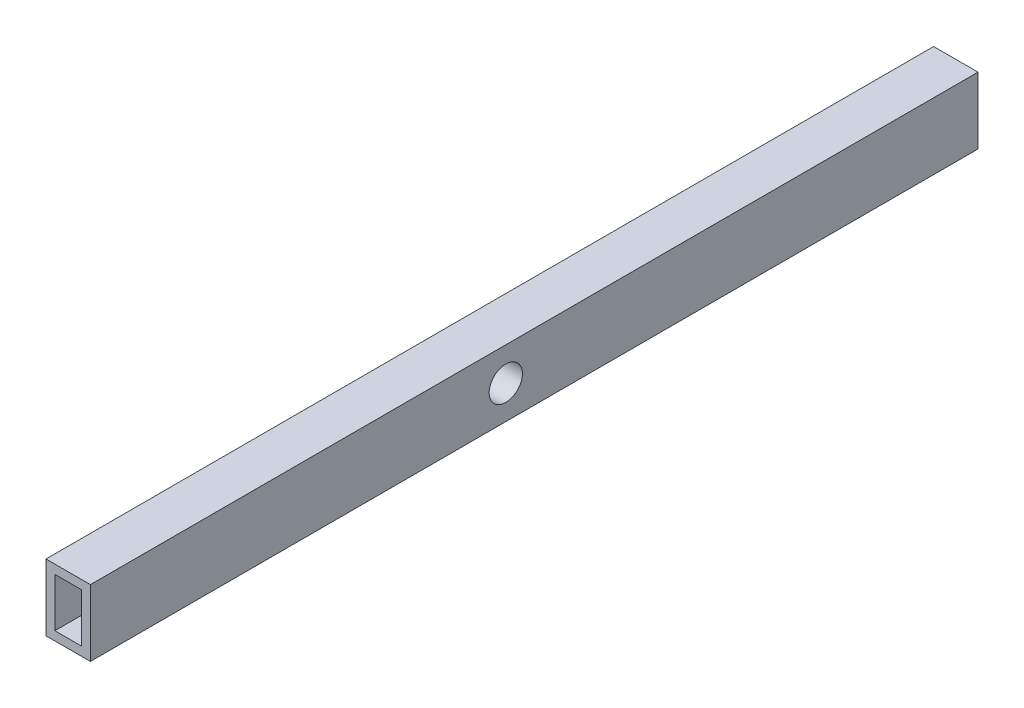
from build123d import *

# Parameters (mm, degrees)
SKETCH1_W                       = 12.7
SKETCH1_H                       = 19.05
SKETCH1_W_2                     = 7.62
SKETCH1_H_2                     = 13.97
EXTRUDE_THIN1_DEPTH             = 254
F_3_8_0_375000_DIAMETER_HOLE1_D = 9.525
EXTRUDE_THIN2_START             = -12.7
SKETCH5_R                       = 6.35
SKETCH5_R_2                     = 4.7625
EXTRUDE_THIN2_DEPTH             = 12.7


with BuildPart() as part:
    # Sketch1 → Extrude-Thin1 (new body)
    with BuildSketch(Plane.XY):
        with Locations((6.35, 9.525)):
            Rectangle(SKETCH1_W, SKETCH1_H)
        with Locations((6.35, 9.525)):
            Rectangle(SKETCH1_W_2, SKETCH1_H_2, mode=Mode.SUBTRACT)
    extrude(amount=EXTRUDE_THIN1_DEPTH)

    # 3_8 _0.375000_ Diameter Hole1 (through all)
    with Locations(Plane(origin=(12.7, 0, 0), x_dir=(0, 0, -1), z_dir=(1, 0, 0))):
        with Locations((-135.129858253, 9.525)):
            Hole(F_3_8_0_375000_DIAMETER_HOLE1_D / 2)

    # Sketch5 → Extrude-Thin2 (add)
    with BuildSketch(Plane(origin=(12.7, 0, 0), x_dir=(0, 0, -1), z_dir=(1, 0, 0)).offset(EXTRUDE_THIN2_START)):
        with Locations((-135.129858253, 9.525)):
            Circle(SKETCH5_R)
        with Locations((-135.129858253, 9.525)):
            Circle(SKETCH5_R_2, mode=Mode.SUBTRACT)
    extrude(amount=EXTRUDE_THIN2_DEPTH)


solid = part.part
